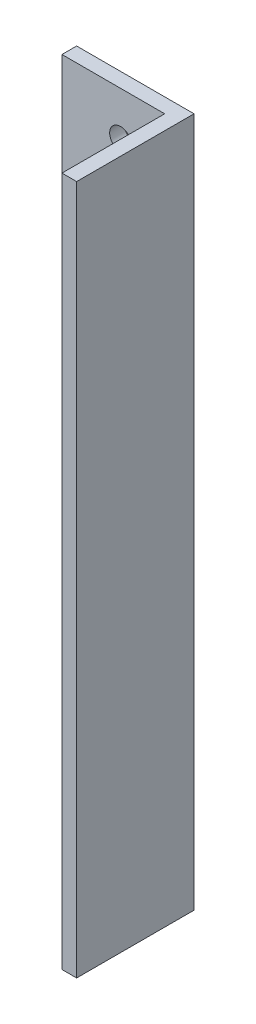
ISO-10303-21;
HEADER;
FILE_DESCRIPTION(('STEP AP214'),'2;1');
FILE_NAME('part.step','',(''),(''),'','','');
FILE_SCHEMA(('AUTOMOTIVE_DESIGN { 1 0 10303 214 1 1 1 1 }'));
ENDSEC;
DATA;
#1=APPLICATION_CONTEXT('core data for automotive mechanical design processes');
#2=APPLICATION_PROTOCOL_DEFINITION('international standard','automotive_design',2000,#1);
#3=PRODUCT_CONTEXT('',#1,'mechanical');
#4=PRODUCT('Part','Part','',(#3));
#5=PRODUCT_RELATED_PRODUCT_CATEGORY('part','',(#4));
#6=PRODUCT_DEFINITION_FORMATION('','',#4);
#7=PRODUCT_DEFINITION_CONTEXT('part definition',#1,'design');
#8=PRODUCT_DEFINITION('design','',#6,#7);
#9=PRODUCT_DEFINITION_SHAPE('','',#8);
#10=(LENGTH_UNIT() NAMED_UNIT(*) SI_UNIT(.MILLI.,.METRE.));
#11=(NAMED_UNIT(*) PLANE_ANGLE_UNIT() SI_UNIT($,.RADIAN.));
#12=(NAMED_UNIT(*) SI_UNIT($,.STERADIAN.) SOLID_ANGLE_UNIT());
#13=UNCERTAINTY_MEASURE_WITH_UNIT(LENGTH_MEASURE(1.E-05),#10,'distance_accuracy_value','');
#14=(GEOMETRIC_REPRESENTATION_CONTEXT(3) GLOBAL_UNCERTAINTY_ASSIGNED_CONTEXT((#13)) GLOBAL_UNIT_ASSIGNED_CONTEXT((#10,
#11,#12)) REPRESENTATION_CONTEXT('',''));
#15=CARTESIAN_POINT('',(0.,0.,0.));
#16=DIRECTION('',(0.,0.,1.));
#17=DIRECTION('',(1.,0.,0.));
#18=AXIS2_PLACEMENT_3D('',#15,#16,#17);
#19=CARTESIAN_POINT('',(12.7,74.6125,12.7));
#20=DIRECTION('',(-1.,0.,0.));
#21=DIRECTION('',(0.,0.,1.));
#22=AXIS2_PLACEMENT_3D('',#19,#20,#21);
#23=PLANE('',#22);
#24=DIRECTION('',(0.,0.,-1.));
#25=VECTOR('',#24,1.);
#26=CARTESIAN_POINT('',(12.7,-74.6125,12.7));
#27=LINE('',#26,#25);
#28=CARTESIAN_POINT('',(12.7,-74.6125,12.7));
#29=VERTEX_POINT('',#28);
#30=CARTESIAN_POINT('',(12.7,-74.6125,-12.7));
#31=VERTEX_POINT('',#30);
#32=EDGE_CURVE('E119',#29,#31,#27,.T.);
#33=ORIENTED_EDGE('',*,*,#32,.T.);
#34=DIRECTION('',(0.,-1.,0.));
#35=VECTOR('',#34,1.);
#36=CARTESIAN_POINT('',(12.7,74.6125,-12.7));
#37=LINE('',#36,#35);
#38=CARTESIAN_POINT('',(12.7,74.6125,-12.7));
#39=VERTEX_POINT('',#38);
#40=EDGE_CURVE('E138',#39,#31,#37,.T.);
#41=ORIENTED_EDGE('',*,*,#40,.F.);
#42=DIRECTION('',(0.,0.,-1.));
#43=VECTOR('',#42,1.);
#44=CARTESIAN_POINT('',(12.7,74.6125,12.7));
#45=LINE('',#44,#43);
#46=CARTESIAN_POINT('',(12.7,74.6125,12.7));
#47=VERTEX_POINT('',#46);
#48=EDGE_CURVE('E131',#47,#39,#45,.T.);
#49=ORIENTED_EDGE('',*,*,#48,.F.);
#50=DIRECTION('',(0.,-1.,0.));
#51=VECTOR('',#50,1.);
#52=CARTESIAN_POINT('',(12.7,74.6125,12.7));
#53=LINE('',#52,#51);
#54=EDGE_CURVE('E115',#47,#29,#53,.T.);
#55=ORIENTED_EDGE('',*,*,#54,.T.);
#56=EDGE_LOOP('',(#33,#41,#49,#55));
#57=FACE_BOUND('',#56,.T.);
#58=ADVANCED_FACE('F33',(#57),#23,.F.);
#59=CARTESIAN_POINT('',(-12.7,74.6125,-12.7));
#60=DIRECTION('',(0.,0.,1.));
#61=DIRECTION('',(1.,0.,0.));
#62=AXIS2_PLACEMENT_3D('',#59,#60,#61);
#63=PLANE('',#62);
#64=CARTESIAN_POINT('',(0.,39.6875,-12.7));
#65=DIRECTION('',(0.,0.,-1.));
#66=DIRECTION('',(-1.,0.,0.));
#67=AXIS2_PLACEMENT_3D('',#64,#65,#66);
#68=CIRCLE('',#67,2.38125);
#69=CARTESIAN_POINT('',(-2.38125,39.6875,-12.7));
#70=VERTEX_POINT('',#69);
#71=EDGE_CURVE('E213',#70,#70,#68,.T.);
#72=ORIENTED_EDGE('',*,*,#71,.F.);
#73=EDGE_LOOP('',(#72));
#74=FACE_BOUND('',#73,.T.);
#75=CARTESIAN_POINT('',(0.,65.0875,-12.7));
#76=DIRECTION('',(0.,0.,-1.));
#77=DIRECTION('',(-1.,0.,0.));
#78=AXIS2_PLACEMENT_3D('',#75,#76,#77);
#79=CIRCLE('',#78,2.38125);
#80=CARTESIAN_POINT('',(-2.38125,65.0875,-12.7));
#81=VERTEX_POINT('',#80);
#82=EDGE_CURVE('E143',#81,#81,#79,.T.);
#83=ORIENTED_EDGE('',*,*,#82,.F.);
#84=EDGE_LOOP('',(#83));
#85=FACE_BOUND('',#84,.T.);
#86=DIRECTION('',(-1.,0.,0.));
#87=VECTOR('',#86,1.);
#88=CARTESIAN_POINT('',(-12.7,-74.6125,-12.7));
#89=LINE('',#88,#87);
#90=CARTESIAN_POINT('',(-12.7,-74.6125,-12.7));
#91=VERTEX_POINT('',#90);
#92=EDGE_CURVE('E122',#31,#91,#89,.T.);
#93=ORIENTED_EDGE('',*,*,#92,.T.);
#94=DIRECTION('',(0.,-1.,0.));
#95=VECTOR('',#94,1.);
#96=CARTESIAN_POINT('',(-12.7,74.6125,-12.7));
#97=LINE('',#96,#95);
#98=CARTESIAN_POINT('',(-12.7,74.6125,-12.7));
#99=VERTEX_POINT('',#98);
#100=EDGE_CURVE('E135',#99,#91,#97,.T.);
#101=ORIENTED_EDGE('',*,*,#100,.F.);
#102=DIRECTION('',(-1.,0.,0.));
#103=VECTOR('',#102,1.);
#104=CARTESIAN_POINT('',(-12.7,74.6125,-12.7));
#105=LINE('',#104,#103);
#106=EDGE_CURVE('E87',#39,#99,#105,.T.);
#107=ORIENTED_EDGE('',*,*,#106,.F.);
#108=ORIENTED_EDGE('',*,*,#40,.T.);
#109=EDGE_LOOP('',(#93,#101,#107,#108));
#110=FACE_BOUND('',#109,.T.);
#111=CARTESIAN_POINT('',(0.,14.2875,-12.7));
#112=DIRECTION('',(0.,0.,-1.));
#113=DIRECTION('',(-1.,0.,0.));
#114=AXIS2_PLACEMENT_3D('',#111,#112,#113);
#115=CIRCLE('',#114,2.38125);
#116=CARTESIAN_POINT('',(-2.38125,14.2875,-12.7));
#117=VERTEX_POINT('',#116);
#118=EDGE_CURVE('E140',#117,#117,#115,.T.);
#119=ORIENTED_EDGE('',*,*,#118,.F.);
#120=EDGE_LOOP('',(#119));
#121=FACE_BOUND('',#120,.T.);
#122=CARTESIAN_POINT('',(0.,-11.1125,-12.7));
#123=DIRECTION('',(0.,0.,-1.));
#124=DIRECTION('',(-1.,0.,0.));
#125=AXIS2_PLACEMENT_3D('',#122,#123,#124);
#126=CIRCLE('',#125,2.38125);
#127=CARTESIAN_POINT('',(-2.38125,-11.1125,-12.7));
#128=VERTEX_POINT('',#127);
#129=EDGE_CURVE('E42',#128,#128,#126,.T.);
#130=ORIENTED_EDGE('',*,*,#129,.F.);
#131=EDGE_LOOP('',(#130));
#132=FACE_BOUND('',#131,.T.);
#133=ADVANCED_FACE('F153',(#74,#85,#110,#121,#132),#63,.F.);
#134=CARTESIAN_POINT('',(-12.7,74.6125,-9.525));
#135=DIRECTION('',(1.,0.,0.));
#136=DIRECTION('',(0.,0.,-1.));
#137=AXIS2_PLACEMENT_3D('',#134,#135,#136);
#138=PLANE('',#137);
#139=DIRECTION('',(0.,0.,1.));
#140=VECTOR('',#139,1.);
#141=CARTESIAN_POINT('',(-12.7,-74.6125,-9.525));
#142=LINE('',#141,#140);
#143=CARTESIAN_POINT('',(-12.7,-74.6125,-9.525));
#144=VERTEX_POINT('',#143);
#145=EDGE_CURVE('E125',#91,#144,#142,.T.);
#146=ORIENTED_EDGE('',*,*,#145,.T.);
#147=DIRECTION('',(0.,-1.,0.));
#148=VECTOR('',#147,1.);
#149=CARTESIAN_POINT('',(-12.7,74.6125,-9.525));
#150=LINE('',#149,#148);
#151=CARTESIAN_POINT('',(-12.7,74.6125,-9.525));
#152=VERTEX_POINT('',#151);
#153=EDGE_CURVE('E110',#152,#144,#150,.T.);
#154=ORIENTED_EDGE('',*,*,#153,.F.);
#155=DIRECTION('',(0.,0.,1.));
#156=VECTOR('',#155,1.);
#157=CARTESIAN_POINT('',(-12.7,74.6125,-9.525));
#158=LINE('',#157,#156);
#159=EDGE_CURVE('E100',#99,#152,#158,.T.);
#160=ORIENTED_EDGE('',*,*,#159,.F.);
#161=ORIENTED_EDGE('',*,*,#100,.T.);
#162=EDGE_LOOP('',(#146,#154,#160,#161));
#163=FACE_BOUND('',#162,.T.);
#164=ADVANCED_FACE('F155',(#163),#138,.F.);
#165=CARTESIAN_POINT('',(-9.525,74.6125,-9.525));
#166=DIRECTION('',(0.,0.,-1.));
#167=DIRECTION('',(-1.,0.,0.));
#168=AXIS2_PLACEMENT_3D('',#165,#166,#167);
#169=PLANE('',#168);
#170=CARTESIAN_POINT('',(0.,39.6875,-9.52499999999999));
#171=DIRECTION('',(0.,0.,-1.));
#172=DIRECTION('',(-1.,0.,0.));
#173=AXIS2_PLACEMENT_3D('',#170,#171,#172);
#174=CIRCLE('',#173,2.38125);
#175=CARTESIAN_POINT('',(-2.38125,39.6875,-9.52499999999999));
#176=VERTEX_POINT('',#175);
#177=EDGE_CURVE('E211',#176,#176,#174,.T.);
#178=ORIENTED_EDGE('',*,*,#177,.T.);
#179=EDGE_LOOP('',(#178));
#180=FACE_BOUND('',#179,.T.);
#181=CARTESIAN_POINT('',(0.,65.0875,-9.52499999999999));
#182=DIRECTION('',(0.,0.,-1.));
#183=DIRECTION('',(-1.,0.,0.));
#184=AXIS2_PLACEMENT_3D('',#181,#182,#183);
#185=CIRCLE('',#184,2.38125);
#186=CARTESIAN_POINT('',(-2.38125,65.0875,-9.52499999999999));
#187=VERTEX_POINT('',#186);
#188=EDGE_CURVE('E123',#187,#187,#185,.T.);
#189=ORIENTED_EDGE('',*,*,#188,.T.);
#190=EDGE_LOOP('',(#189));
#191=FACE_BOUND('',#190,.T.);
#192=DIRECTION('',(1.,0.,0.));
#193=VECTOR('',#192,1.);
#194=CARTESIAN_POINT('',(-9.525,-74.6125,-9.525));
#195=LINE('',#194,#193);
#196=CARTESIAN_POINT('',(9.525,-74.6125,-9.52499999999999));
#197=VERTEX_POINT('',#196);
#198=EDGE_CURVE('E109',#144,#197,#195,.T.);
#199=ORIENTED_EDGE('',*,*,#198,.T.);
#200=DIRECTION('',(0.,-1.,0.));
#201=VECTOR('',#200,1.);
#202=CARTESIAN_POINT('',(9.525,74.6125,-9.52499999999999));
#203=LINE('',#202,#201);
#204=CARTESIAN_POINT('',(9.525,74.6125,-9.52499999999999));
#205=VERTEX_POINT('',#204);
#206=EDGE_CURVE('E106',#205,#197,#203,.T.);
#207=ORIENTED_EDGE('',*,*,#206,.F.);
#208=DIRECTION('',(1.,0.,0.));
#209=VECTOR('',#208,1.);
#210=CARTESIAN_POINT('',(-9.525,74.6125,-9.525));
#211=LINE('',#210,#209);
#212=EDGE_CURVE('E94',#152,#205,#211,.T.);
#213=ORIENTED_EDGE('',*,*,#212,.F.);
#214=ORIENTED_EDGE('',*,*,#153,.T.);
#215=EDGE_LOOP('',(#199,#207,#213,#214));
#216=FACE_BOUND('',#215,.T.);
#217=CARTESIAN_POINT('',(0.,14.2875,-9.52499999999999));
#218=DIRECTION('',(0.,0.,-1.));
#219=DIRECTION('',(-1.,0.,0.));
#220=AXIS2_PLACEMENT_3D('',#217,#218,#219);
#221=CIRCLE('',#220,2.38125);
#222=CARTESIAN_POINT('',(-2.38125,14.2875,-9.52499999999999));
#223=VERTEX_POINT('',#222);
#224=EDGE_CURVE('E146',#223,#223,#221,.T.);
#225=ORIENTED_EDGE('',*,*,#224,.T.);
#226=EDGE_LOOP('',(#225));
#227=FACE_BOUND('',#226,.T.);
#228=CARTESIAN_POINT('',(0.,-11.1125,-9.52499999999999));
#229=DIRECTION('',(0.,0.,-1.));
#230=DIRECTION('',(-1.,0.,0.));
#231=AXIS2_PLACEMENT_3D('',#228,#229,#230);
#232=CIRCLE('',#231,2.38125);
#233=CARTESIAN_POINT('',(-2.38125,-11.1125,-9.52499999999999));
#234=VERTEX_POINT('',#233);
#235=EDGE_CURVE('E11',#234,#234,#232,.T.);
#236=ORIENTED_EDGE('',*,*,#235,.T.);
#237=EDGE_LOOP('',(#236));
#238=FACE_BOUND('',#237,.T.);
#239=ADVANCED_FACE('F107',(#180,#191,#216,#227,#238),#169,.F.);
#240=CARTESIAN_POINT('',(9.525,74.6125,9.525));
#241=DIRECTION('',(1.,0.,0.));
#242=DIRECTION('',(0.,0.,-1.));
#243=AXIS2_PLACEMENT_3D('',#240,#241,#242);
#244=PLANE('',#243);
#245=DIRECTION('',(0.,0.,1.));
#246=VECTOR('',#245,1.);
#247=CARTESIAN_POINT('',(9.525,-74.6125,9.525));
#248=LINE('',#247,#246);
#249=CARTESIAN_POINT('',(9.525,-74.6125,12.7));
#250=VERTEX_POINT('',#249);
#251=EDGE_CURVE('E72',#197,#250,#248,.T.);
#252=ORIENTED_EDGE('',*,*,#251,.T.);
#253=DIRECTION('',(0.,-1.,0.));
#254=VECTOR('',#253,1.);
#255=CARTESIAN_POINT('',(9.525,74.6125,12.7));
#256=LINE('',#255,#254);
#257=CARTESIAN_POINT('',(9.525,74.6125,12.7));
#258=VERTEX_POINT('',#257);
#259=EDGE_CURVE('E111',#258,#250,#256,.T.);
#260=ORIENTED_EDGE('',*,*,#259,.F.);
#261=DIRECTION('',(0.,0.,1.));
#262=VECTOR('',#261,1.);
#263=CARTESIAN_POINT('',(9.525,74.6125,9.525));
#264=LINE('',#263,#262);
#265=EDGE_CURVE('E98',#205,#258,#264,.T.);
#266=ORIENTED_EDGE('',*,*,#265,.F.);
#267=ORIENTED_EDGE('',*,*,#206,.T.);
#268=EDGE_LOOP('',(#252,#260,#266,#267));
#269=FACE_BOUND('',#268,.T.);
#270=ADVANCED_FACE('F113',(#269),#244,.F.);
#271=CARTESIAN_POINT('',(9.525,74.6125,12.7));
#272=DIRECTION('',(0.,0.,-1.));
#273=DIRECTION('',(-1.,0.,0.));
#274=AXIS2_PLACEMENT_3D('',#271,#272,#273);
#275=PLANE('',#274);
#276=DIRECTION('',(1.,0.,0.));
#277=VECTOR('',#276,1.);
#278=CARTESIAN_POINT('',(9.525,-74.6125,12.7));
#279=LINE('',#278,#277);
#280=EDGE_CURVE('E78',#250,#29,#279,.T.);
#281=ORIENTED_EDGE('',*,*,#280,.T.);
#282=ORIENTED_EDGE('',*,*,#54,.F.);
#283=DIRECTION('',(1.,0.,0.));
#284=VECTOR('',#283,1.);
#285=CARTESIAN_POINT('',(9.525,74.6125,12.7));
#286=LINE('',#285,#284);
#287=EDGE_CURVE('E50',#258,#47,#286,.T.);
#288=ORIENTED_EDGE('',*,*,#287,.F.);
#289=ORIENTED_EDGE('',*,*,#259,.T.);
#290=EDGE_LOOP('',(#281,#282,#288,#289));
#291=FACE_BOUND('',#290,.T.);
#292=ADVANCED_FACE('F190',(#291),#275,.F.);
#293=CARTESIAN_POINT('',(0.,74.6125,0.));
#294=DIRECTION('',(0.,-1.,0.));
#295=DIRECTION('',(0.,0.,-1.));
#296=AXIS2_PLACEMENT_3D('',#293,#294,#295);
#297=PLANE('',#296);
#298=ORIENTED_EDGE('',*,*,#48,.T.);
#299=ORIENTED_EDGE('',*,*,#106,.T.);
#300=ORIENTED_EDGE('',*,*,#159,.T.);
#301=ORIENTED_EDGE('',*,*,#212,.T.);
#302=ORIENTED_EDGE('',*,*,#265,.T.);
#303=ORIENTED_EDGE('',*,*,#287,.T.);
#304=EDGE_LOOP('',(#298,#299,#300,#301,#302,#303));
#305=FACE_BOUND('',#304,.T.);
#306=ADVANCED_FACE('F96',(#305),#297,.F.);
#307=CARTESIAN_POINT('',(0.,-74.6125,0.));
#308=DIRECTION('',(0.,-1.,0.));
#309=DIRECTION('',(0.,0.,-1.));
#310=AXIS2_PLACEMENT_3D('',#307,#308,#309);
#311=PLANE('',#310);
#312=ORIENTED_EDGE('',*,*,#32,.F.);
#313=ORIENTED_EDGE('',*,*,#280,.F.);
#314=ORIENTED_EDGE('',*,*,#251,.F.);
#315=ORIENTED_EDGE('',*,*,#198,.F.);
#316=ORIENTED_EDGE('',*,*,#145,.F.);
#317=ORIENTED_EDGE('',*,*,#92,.F.);
#318=EDGE_LOOP('',(#312,#313,#314,#315,#316,#317));
#319=FACE_BOUND('',#318,.T.);
#320=ADVANCED_FACE('F197',(#319),#311,.T.);
#321=CARTESIAN_POINT('',(0.,65.0875,12.7));
#322=DIRECTION('',(0.,0.,-1.));
#323=DIRECTION('',(-1.,0.,0.));
#324=AXIS2_PLACEMENT_3D('',#321,#322,#323);
#325=CYLINDRICAL_SURFACE('',#324,2.38125);
#326=ORIENTED_EDGE('',*,*,#82,.T.);
#327=EDGE_LOOP('',(#326));
#328=FACE_BOUND('',#327,.T.);
#329=ORIENTED_EDGE('',*,*,#188,.F.);
#330=EDGE_LOOP('',(#329));
#331=FACE_BOUND('',#330,.T.);
#332=ADVANCED_FACE('F177',(#328,#331),#325,.F.);
#333=CARTESIAN_POINT('',(0.,39.6875,12.7));
#334=DIRECTION('',(0.,0.,-1.));
#335=DIRECTION('',(-1.,0.,0.));
#336=AXIS2_PLACEMENT_3D('',#333,#334,#335);
#337=CYLINDRICAL_SURFACE('',#336,2.38125);
#338=ORIENTED_EDGE('',*,*,#71,.T.);
#339=EDGE_LOOP('',(#338));
#340=FACE_BOUND('',#339,.T.);
#341=ORIENTED_EDGE('',*,*,#177,.F.);
#342=EDGE_LOOP('',(#341));
#343=FACE_BOUND('',#342,.T.);
#344=ADVANCED_FACE('F171',(#340,#343),#337,.F.);
#345=CARTESIAN_POINT('',(0.,14.2875,12.7));
#346=DIRECTION('',(0.,0.,-1.));
#347=DIRECTION('',(-1.,0.,0.));
#348=AXIS2_PLACEMENT_3D('',#345,#346,#347);
#349=CYLINDRICAL_SURFACE('',#348,2.38125);
#350=ORIENTED_EDGE('',*,*,#118,.T.);
#351=EDGE_LOOP('',(#350));
#352=FACE_BOUND('',#351,.T.);
#353=ORIENTED_EDGE('',*,*,#224,.F.);
#354=EDGE_LOOP('',(#353));
#355=FACE_BOUND('',#354,.T.);
#356=ADVANCED_FACE('F169',(#352,#355),#349,.F.);
#357=CARTESIAN_POINT('',(0.,-11.1125,12.7));
#358=DIRECTION('',(0.,0.,-1.));
#359=DIRECTION('',(-1.,0.,0.));
#360=AXIS2_PLACEMENT_3D('',#357,#358,#359);
#361=CYLINDRICAL_SURFACE('',#360,2.38125);
#362=ORIENTED_EDGE('',*,*,#129,.T.);
#363=EDGE_LOOP('',(#362));
#364=FACE_BOUND('',#363,.T.);
#365=ORIENTED_EDGE('',*,*,#235,.F.);
#366=EDGE_LOOP('',(#365));
#367=FACE_BOUND('',#366,.T.);
#368=ADVANCED_FACE('F35',(#364,#367),#361,.F.);
#369=CLOSED_SHELL('',(#58,#133,#164,#239,#270,#292,#306,#320,#332,#344,#356,#368));
#370=MANIFOLD_SOLID_BREP('B2',#369);
#371=ADVANCED_BREP_SHAPE_REPRESENTATION('',(#18,#370),#14);
#372=SHAPE_DEFINITION_REPRESENTATION(#9,#371);
ENDSEC;
END-ISO-10303-21;
